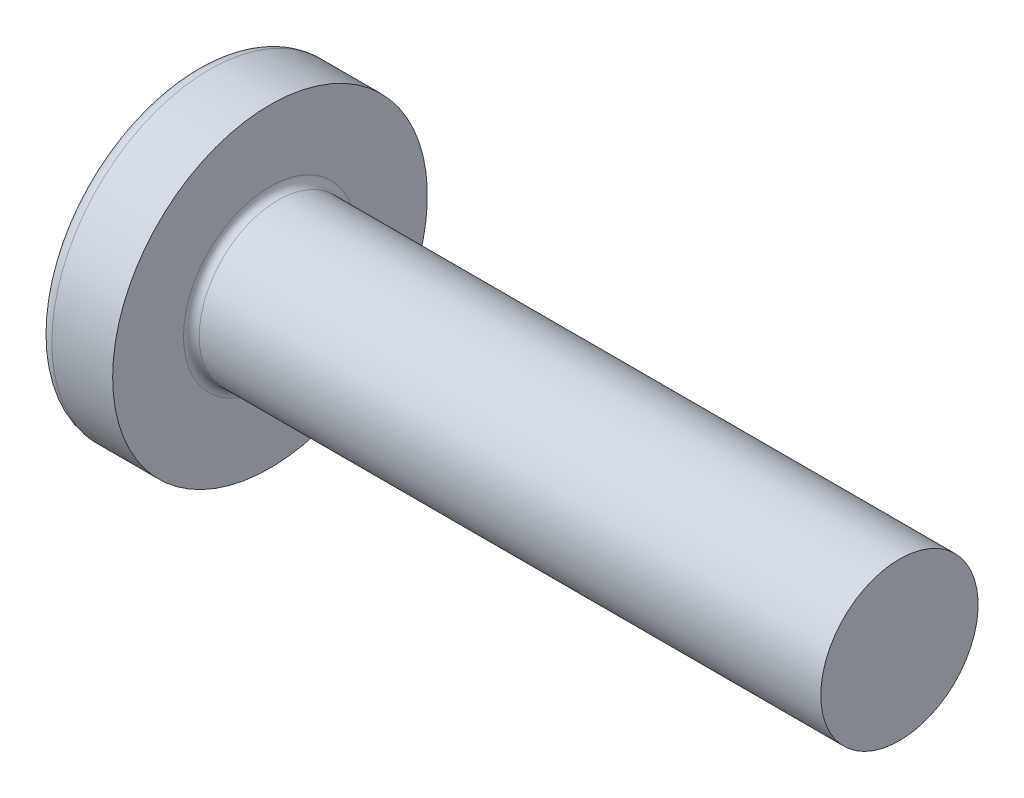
from build123d import *

# Parameters (mm, degrees)
FILLET1_R    = 0.2
RECPAT_COUNT = 2
RECPAT_ANGLE = 90


with BuildPart() as part:
    # BodySke → Base-Revolve (revolve)
    with BuildSketch(Plane.XY, mode=Mode.PRIVATE) as base_revolve_sk:
        with BuildLine():
            Line((3.1, 2), (3.1, 4))
            Line((3.1, 4), (1.555305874, 4))
            ThreePointArc((1.555305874, 4), (1.392873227, 3.961271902), (1.265388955, 3.853420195))
            ThreePointArc((1.265388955, 3.853420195), (0.324444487, 2.027933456), (0, 0))
            Line((0, 0), (19.1, 0))
            Line((19.1, 0), (19.1, 2))
            Line((19.1, 2), (3.1, 2))
        make_face()
    revolve(base_revolve_sk.sketch.rotate(Axis((1.555305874, 0, 0), (1, 0, 0)), 90), axis=Axis((1.555305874, 0, 0), (1, 0, 0)))

    # Fillet1
    fillet1_edges = [part.edges().sort_by_distance(p)[0] for p in [
        (3.1, 0, -2),
    ]]
    fillet(fillet1_edges, radius=FILLET1_R)

    # Sketch3 → Recess section 0
    with BuildSketch(Plane(origin=(0, 0, 0), x_dir=(0, 0, -1), z_dir=(1, 0, 0))):
        with BuildLine():
            Line((0.515, -2.15), (-0.515, -2.15))
            Line((-0.515, -2.15), (-0.515, 2.15))
            Line((-0.515, 2.15), (0.515, 2.15))
            Line((0.515, 2.15), (0.515, -2.15))
        make_face()
    # Sketch4 → Recess section 1
    with BuildSketch(Plane(origin=(2.34, 0, 0), x_dir=(0, 0, -1), z_dir=(1, 0, 0))):
        with BuildLine():
            Line((0.515, -0.983319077), (-0.515, -0.983319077))
            Line((-0.515, -0.983319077), (-0.515, 0.983319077))
            Line((-0.515, 0.983319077), (0.515, 0.983319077))
            Line((0.515, 0.983319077), (0.515, -0.983319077))
        make_face()
    recess = loft(mode=Mode.SUBTRACT)

    # RecPat: Recess ×2 about axis
    recpat_axis = Axis((0, 0, 0), (1, 0, 0))
    for i in range(1, RECPAT_COUNT):
        add(recess.rotate(recpat_axis, i * RECPAT_ANGLE / (RECPAT_COUNT - 1)), mode=Mode.SUBTRACT)

    # RecCorSke → RecessCore (revolve, cut)
    with BuildSketch(Plane.XY, mode=Mode.PRIVATE) as recesscore_sk:
        Polygon((0, 0), (0, 1.01462874), (2.34, 0.851), (2.616506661, 0), align=None)
    revolve(recesscore_sk.sketch.rotate(Axis((-3.175, 0, 0), (1, 0, 0)), 345.452408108), axis=Axis((-3.175, 0, 0), (1, 0, 0)), mode=Mode.SUBTRACT)


solid = part.part
